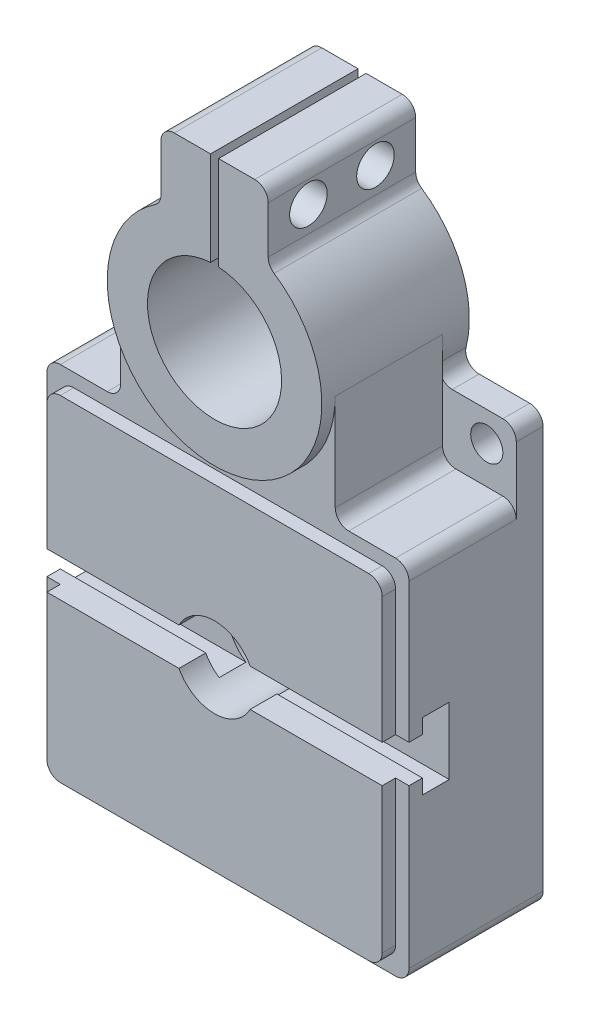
from build123d import *

# Parameters (mm, degrees)
SKETCH_1_R           = 25
SKETCH_1_R_2         = 6
EXTRUDE_1_DEPTH      = 10
SKETCH_2_R           = 25
EXTRUDE_2_DEPTH      = 40
EXTRUDE_3_DEPTH      = 5
SKETCH_4_R           = 25
EXTRUDE_4_DEPTH      = 5
CUT_EXTRUDE_1_DEPTH  = 45
SKETCH_6_W           = 115
SKETCH_6_H           = 40
EXTRUDE_5_DEPTH      = 20
FILLET_1_R           = 10
FILLET_2_R           = 10
CUT_EXTRUDE_3_DEPTH  = 148
SKETCH_8_R           = 15
CUT_EXTRUDE_4_DEPTH  = 181.779561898
SKETCH_9_W           = 3
SKETCH_9_H           = 60
CUT_EXTRUDE_5_DEPTH  = 41
SKETCH_10_R          = 7
CUT_EXTRUDE_6_DEPTH  = 10
SKETCH_11_R          = 4.5
CUT_EXTRUDE_8_DEPTH  = 45
SKETCH_12_R          = 10
SKETCH_12_R_2        = 2.5
CUT_EXTRUDE_9_DEPTH  = 10
SKETCH_13_R          = 10.5
CUT_EXTRUDE_11_DEPTH = 15


with BuildPart() as part:
    # Sketch 1 → Extrude 1 (new body)
    with BuildSketch(Plane.XY):
        with BuildLine():
            Line((67.5, 84), (67.5, -66))
            ThreePointArc((67.5, -66), (66.035533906, -69.535533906), (62.5, -71))
            Line((62.5, -71), (-62.5, -71))
            ThreePointArc((-62.5, -71), (-66.035533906, -69.535533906), (-67.5, -66))
            Line((-67.5, -66), (-67.5, 84))
            ThreePointArc((-67.5, 84), (-66.035533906, 87.535533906), (-62.5, 89))
            Line((-62.5, 89), (-43.634848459, 89))
            ThreePointArc((-43.634848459, 89), (-39.69079527, 90.926818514), (-38.786531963, 95.222222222))
            ThreePointArc((-38.786531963, 95.222222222), (-37.330441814, 119.367954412), (-22.222222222, 138.259176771))
            ThreePointArc((-22.222222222, 138.259176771), (-20.590414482, 140.059551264), (-20, 142.416573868))
            Line((-20, 142.416573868), (-20, 160))
            ThreePointArc((-20, 160), (-18.535533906, 163.535533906), (-15, 165))
            Line((-15, 165), (0, 165))
            Line((0, 165), (15, 165))
            ThreePointArc((15, 165), (18.535533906, 163.535533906), (20, 160))
            Line((20, 160), (20, 142.416573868))
            ThreePointArc((20, 142.416573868), (20.590414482, 140.059551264), (22.222222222, 138.259176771))
            ThreePointArc((22.222222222, 138.259176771), (37.330441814, 119.367954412), (38.786531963, 95.222222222))
            ThreePointArc((38.786531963, 95.222222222), (39.69079527, 90.926818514), (43.634848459, 89))
            Line((43.634848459, 89), (62.5, 89))
            ThreePointArc((62.5, 89), (66.035533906, 87.535533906), (67.5, 84))
        make_face()
        with Locations((0, 105)):
            Circle(SKETCH_1_R, mode=Mode.SUBTRACT)
        with Locations((-56.5, 78)):
            Circle(SKETCH_1_R_2, mode=Mode.SUBTRACT)
        with Locations(Location((56.5, 78, 0), (0, 0, 180))):
            Circle(SKETCH_1_R_2, mode=Mode.SUBTRACT)
    extrude(amount=EXTRUDE_1_DEPTH)

    # Sketch 2 → Extrude 2 (add)
    with BuildSketch(Plane.XY.offset(10)):
        with BuildLine():
            Line((-62.5, -71), (62.5, -71))
            ThreePointArc((62.5, -71), (66.035533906, -69.535533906), (67.5, -66))
            Line((67.5, -66), (67.5, 59))
            ThreePointArc((67.5, 59), (66.035533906, 62.535533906), (62.5, 64))
            Line((62.5, 64), (45, 64))
            ThreePointArc((45, 64), (41.464466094, 65.464466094), (40, 69))
            Line((40, 69), (40, 105))
            ThreePointArc((40, 105), (35.276684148, 123.856180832), (22.222222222, 138.259176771))
            ThreePointArc((22.222222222, 138.259176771), (20.590414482, 140.059551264), (20, 142.416573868))
            Line((20, 142.416573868), (20, 160))
            ThreePointArc((20, 160), (18.535533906, 163.535533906), (15, 165))
            Line((15, 165), (-15, 165))
            ThreePointArc((-15, 165), (-18.535533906, 163.535533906), (-20, 160))
            Line((-20, 160), (-20, 142.416573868))
            ThreePointArc((-20, 142.416573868), (-20.590414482, 140.059551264), (-22.222222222, 138.259176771))
            ThreePointArc((-22.222222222, 138.259176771), (-35.276684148, 123.856180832), (-40, 105))
            Line((-40, 105), (-40, 69))
            ThreePointArc((-40, 69), (-41.464466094, 65.464466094), (-45, 64))
            Line((-45, 64), (-62.5, 64))
            ThreePointArc((-62.5, 64), (-66.035533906, 62.535533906), (-67.5, 59))
            Line((-67.5, 59), (-67.5, -66))
            ThreePointArc((-67.5, -66), (-66.035533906, -69.535533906), (-62.5, -71))
        make_face()
        with Locations((0, 105)):
            Circle(SKETCH_2_R, mode=Mode.SUBTRACT)
    extrude(amount=EXTRUDE_2_DEPTH)

    # Sketch 3 → Extrude 3 (add)
    with BuildSketch(Plane.XY.offset(50)):
        with BuildLine():
            Line((-62.5, 54), (-62.5, -61))
            ThreePointArc((-62.5, -61), (-61.035533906, -64.535533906), (-57.5, -66))
            Line((-57.5, -66), (57.5, -66))
            ThreePointArc((57.5, -66), (61.035533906, -64.535533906), (62.5, -61))
            Line((62.5, -61), (62.5, 54))
            ThreePointArc((62.5, 54), (61.035533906, 57.535533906), (57.5, 59))
            Line((57.5, 59), (-57.5, 59))
            ThreePointArc((-57.5, 59), (-61.035533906, 57.535533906), (-62.5, 54))
        make_face()
    extrude(amount=EXTRUDE_3_DEPTH)

    # Sketch 4 → Extrude 4 (add)
    with BuildSketch(Plane.XY.offset(50)):
        with BuildLine():
            Line((20, 142.416573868), (20, 160))
            ThreePointArc((20, 160), (18.535533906, 163.535533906), (15, 165))
            Line((15, 165), (-15, 165))
            ThreePointArc((-15, 165), (-18.535533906, 163.535533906), (-20, 160))
            Line((-20, 160), (-20, 142.416573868))
            ThreePointArc((-20, 142.416573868), (-20.590414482, 140.059551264), (-22.222222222, 138.259176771))
            ThreePointArc((-22.222222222, 138.259176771), (0, 65), (22.222222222, 138.259176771))
            ThreePointArc((22.222222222, 138.259176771), (20.590414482, 140.059551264), (20, 142.416573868))
        make_face()
        with Locations((0, 105)):
            Circle(SKETCH_4_R, mode=Mode.SUBTRACT)
    extrude(amount=EXTRUDE_4_DEPTH)

    # Sketch 5 → Cut-Extrude 1 (cut)
    with BuildSketch(Plane(origin=(0, 0, 0), x_dir=(-1, 0, 0), z_dir=(0, 0, -1))):
        with BuildLine():
            Line((57.5, 49), (57.5, -56))
            ThreePointArc((57.5, -56), (56.035533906, -59.535533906), (52.5, -61))
            Line((52.5, -61), (-52.5, -61))
            ThreePointArc((-52.5, -61), (-56.035533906, -59.535533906), (-57.5, -56))
            Line((-57.5, -56), (-57.5, 49))
            ThreePointArc((-57.5, 49), (-56.035533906, 52.535533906), (-52.5, 54))
            Line((-52.5, 54), (-35, 54))
            ThreePointArc((-35, 54), (-31.464466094, 55.464466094), (-30, 59))
            Line((-30, 59), (-30, 64))
            ThreePointArc((-30, 64), (-28.535533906, 67.535533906), (-25, 69))
            Line((-25, 69), (0, 69))
            Line((0, 69), (25, 69))
            ThreePointArc((25, 69), (28.535533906, 67.535533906), (30, 64))
            Line((30, 64), (30, 59))
            ThreePointArc((30, 59), (31.464466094, 55.464466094), (35, 54))
            Line((35, 54), (52.5, 54))
            ThreePointArc((52.5, 54), (56.035533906, 52.535533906), (57.5, 49))
        make_face()
    extrude(amount=-CUT_EXTRUDE_1_DEPTH, mode=Mode.SUBTRACT)

    # Sketch 6 → Extrude 5 (add)
    with BuildSketch(Plane(origin=(0, 0, 45), x_dir=(-1, 0, 0), z_dir=(0, 0, -1))):
        Rectangle(SKETCH_6_W, SKETCH_6_H)
    extrude(amount=EXTRUDE_5_DEPTH)

    # Fillet 1
    fillet_1_edges = [part.edges().sort_by_distance(p)[0] for p in [
        (57.5, -20, 35),
    ]]
    fillet(fillet_1_edges, radius=FILLET_1_R)

    # Fillet 2
    fillet_2_edges = [part.edges().sort_by_distance(p)[0] for p in [
        (-57.5, -20, 35),
        (-57.5, 20, 35),
        (57.5, 20, 35),
    ]]
    fillet(fillet_2_edges, radius=FILLET_2_R)

    # Sketch 7 → Cut-Extrude 3 (cut)
    with BuildSketch(Plane.ZY.offset(67.5)):
        Polygon((35, 12.5), (35, -12.5), (45, -12.5), (45, -7), (56, -7), (56, 7), (45, 7), (45, 12.5), align=None)
    extrude(amount=-CUT_EXTRUDE_3_DEPTH, mode=Mode.SUBTRACT)

    # Sketch 8 → Cut-Extrude 4 (cut, through all)
    with BuildSketch(Plane(origin=(0, 0, 25), x_dir=(-1, 0, 0), z_dir=(0, 0, -1))):
        Circle(SKETCH_8_R)
    extrude(amount=-CUT_EXTRUDE_4_DEPTH, mode=Mode.SUBTRACT)

    # Sketch 9 → Cut-Extrude 5 (cut)
    with BuildSketch(Plane(origin=(0, 165, 0), x_dir=(1, 0, 0), z_dir=(0, 1, 0))):
        with Locations((0, -27.5)):
            Rectangle(SKETCH_9_W, SKETCH_9_H)
    extrude(amount=-CUT_EXTRUDE_5_DEPTH, mode=Mode.SUBTRACT)

    # Sketch 10 → Cut-Extrude 6 (cut)
    with BuildSketch(Plane(origin=(20, 0, 0), x_dir=(0, 0, -1), z_dir=(1, 0, 0))):
        with Locations(Location((-40, 152, 0), (0, 0, 90))):
            Circle(SKETCH_10_R)
        with Locations(Location((-15, 152, 0), (0, 0, 90))):
            Circle(SKETCH_10_R)
    extrude(amount=-CUT_EXTRUDE_6_DEPTH, mode=Mode.SUBTRACT)

    # Sketch 11 → Cut-Extrude 8 (cut)
    with BuildSketch(Plane(origin=(10, 0, 0), x_dir=(0, 0, -1), z_dir=(1, 0, 0))):
        with Locations(Location((-40, 152, 0), (0, 0, 90))):
            Circle(SKETCH_11_R)
        with Locations(Location((-15, 152, 0), (0, 0, 90))):
            Circle(SKETCH_11_R)
    extrude(amount=-CUT_EXTRUDE_8_DEPTH, mode=Mode.SUBTRACT)

    # Sketch 12 → Cut-Extrude 9 (cut)
    with BuildSketch(Plane.XZ.offset(71)):
        with Locations((32, 25)):
            Circle(SKETCH_12_R)
        with Locations((-47, 25)):
            Circle(SKETCH_12_R_2)
        with Locations((47, 25)):
            Circle(SKETCH_12_R_2)
    extrude(amount=-CUT_EXTRUDE_9_DEPTH, mode=Mode.SUBTRACT)

    # Sketch 13 → Cut-Extrude 11 (cut)
    with BuildSketch(Plane.ZY.offset(67.5)):
        with Locations((22, 37)):
            Circle(SKETCH_13_R)
    extrude(amount=-CUT_EXTRUDE_11_DEPTH, mode=Mode.SUBTRACT)


solid = part.part
